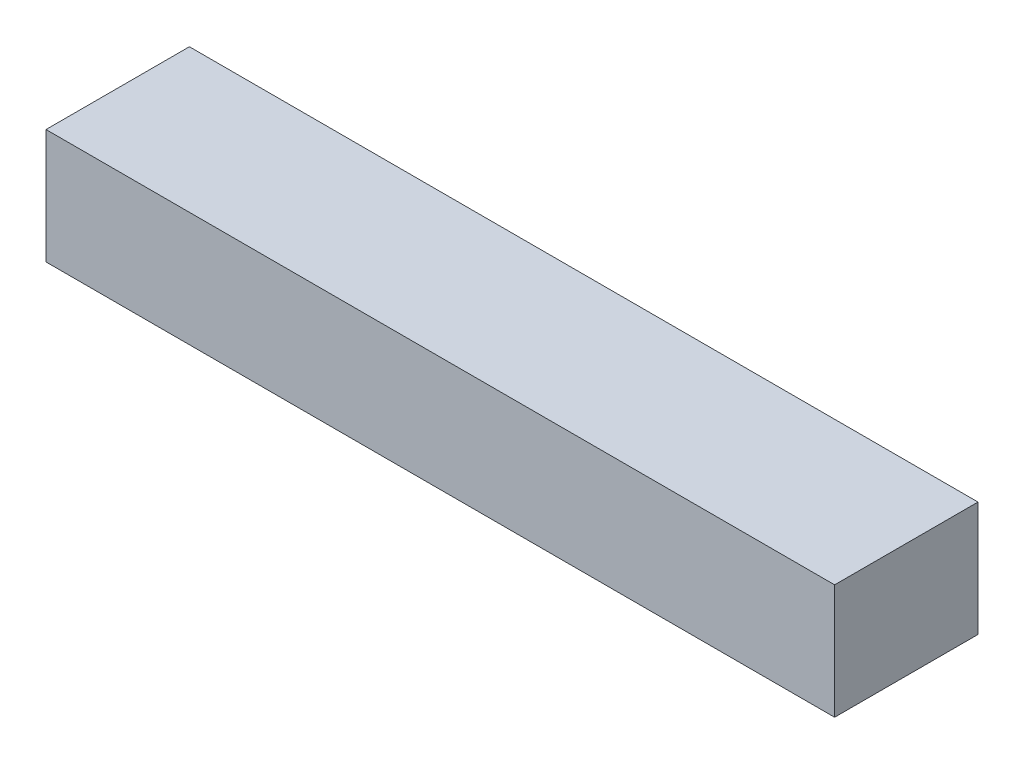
ISO-10303-21;
HEADER;
FILE_DESCRIPTION(('STEP AP214'),'2;1');
FILE_NAME('part.step','',(''),(''),'','','');
FILE_SCHEMA(('AUTOMOTIVE_DESIGN { 1 0 10303 214 1 1 1 1 }'));
ENDSEC;
DATA;
#1=APPLICATION_CONTEXT('core data for automotive mechanical design processes');
#2=APPLICATION_PROTOCOL_DEFINITION('international standard','automotive_design',2000,#1);
#3=PRODUCT_CONTEXT('',#1,'mechanical');
#4=PRODUCT('Part','Part','',(#3));
#5=PRODUCT_RELATED_PRODUCT_CATEGORY('part','',(#4));
#6=PRODUCT_DEFINITION_FORMATION('','',#4);
#7=PRODUCT_DEFINITION_CONTEXT('part definition',#1,'design');
#8=PRODUCT_DEFINITION('design','',#6,#7);
#9=PRODUCT_DEFINITION_SHAPE('','',#8);
#10=(LENGTH_UNIT() NAMED_UNIT(*) SI_UNIT(.MILLI.,.METRE.));
#11=(NAMED_UNIT(*) PLANE_ANGLE_UNIT() SI_UNIT($,.RADIAN.));
#12=(NAMED_UNIT(*) SI_UNIT($,.STERADIAN.) SOLID_ANGLE_UNIT());
#13=UNCERTAINTY_MEASURE_WITH_UNIT(LENGTH_MEASURE(1.E-05),#10,'distance_accuracy_value','');
#14=(GEOMETRIC_REPRESENTATION_CONTEXT(3) GLOBAL_UNCERTAINTY_ASSIGNED_CONTEXT((#13)) GLOBAL_UNIT_ASSIGNED_CONTEXT((#10,
#11,#12)) REPRESENTATION_CONTEXT('',''));
#15=CARTESIAN_POINT('',(0.,0.,0.));
#16=DIRECTION('',(0.,0.,1.));
#17=DIRECTION('',(1.,0.,0.));
#18=AXIS2_PLACEMENT_3D('',#15,#16,#17);
#19=CARTESIAN_POINT('',(27.5,4.,10.));
#20=DIRECTION('',(-1.,0.,0.));
#21=DIRECTION('',(0.,0.,1.));
#22=AXIS2_PLACEMENT_3D('',#19,#20,#21);
#23=PLANE('',#22);
#24=DIRECTION('',(0.,1.,0.));
#25=VECTOR('',#24,1.);
#26=CARTESIAN_POINT('',(27.5,4.,0.));
#27=LINE('',#26,#25);
#28=CARTESIAN_POINT('',(27.5,-4.,0.));
#29=VERTEX_POINT('',#28);
#30=CARTESIAN_POINT('',(27.5,4.,0.));
#31=VERTEX_POINT('',#30);
#32=EDGE_CURVE('E111',#29,#31,#27,.T.);
#33=ORIENTED_EDGE('',*,*,#32,.T.);
#34=DIRECTION('',(0.,0.,-1.));
#35=VECTOR('',#34,1.);
#36=CARTESIAN_POINT('',(27.5,4.,10.));
#37=LINE('',#36,#35);
#38=CARTESIAN_POINT('',(27.5,4.,10.));
#39=VERTEX_POINT('',#38);
#40=EDGE_CURVE('E11',#39,#31,#37,.T.);
#41=ORIENTED_EDGE('',*,*,#40,.F.);
#42=DIRECTION('',(0.,1.,0.));
#43=VECTOR('',#42,1.);
#44=CARTESIAN_POINT('',(27.5,4.,10.));
#45=LINE('',#44,#43);
#46=CARTESIAN_POINT('',(27.5,-4.,10.));
#47=VERTEX_POINT('',#46);
#48=EDGE_CURVE('E95',#47,#39,#45,.T.);
#49=ORIENTED_EDGE('',*,*,#48,.F.);
#50=DIRECTION('',(0.,0.,-1.));
#51=VECTOR('',#50,1.);
#52=CARTESIAN_POINT('',(27.5,-4.,10.));
#53=LINE('',#52,#51);
#54=EDGE_CURVE('E107',#47,#29,#53,.T.);
#55=ORIENTED_EDGE('',*,*,#54,.T.);
#56=EDGE_LOOP('',(#33,#41,#49,#55));
#57=FACE_BOUND('',#56,.T.);
#58=ADVANCED_FACE('F43',(#57),#23,.F.);
#59=CARTESIAN_POINT('',(-27.5,4.,10.));
#60=DIRECTION('',(0.,-1.,0.));
#61=DIRECTION('',(0.,0.,-1.));
#62=AXIS2_PLACEMENT_3D('',#59,#60,#61);
#63=PLANE('',#62);
#64=DIRECTION('',(-1.,0.,0.));
#65=VECTOR('',#64,1.);
#66=CARTESIAN_POINT('',(-27.5,4.,0.));
#67=LINE('',#66,#65);
#68=CARTESIAN_POINT('',(-27.5,4.,0.));
#69=VERTEX_POINT('',#68);
#70=EDGE_CURVE('E100',#31,#69,#67,.T.);
#71=ORIENTED_EDGE('',*,*,#70,.T.);
#72=DIRECTION('',(0.,0.,-1.));
#73=VECTOR('',#72,1.);
#74=CARTESIAN_POINT('',(-27.5,4.,10.));
#75=LINE('',#74,#73);
#76=CARTESIAN_POINT('',(-27.5,4.,10.));
#77=VERTEX_POINT('',#76);
#78=EDGE_CURVE('E52',#77,#69,#75,.T.);
#79=ORIENTED_EDGE('',*,*,#78,.F.);
#80=DIRECTION('',(-1.,0.,0.));
#81=VECTOR('',#80,1.);
#82=CARTESIAN_POINT('',(-27.5,4.,10.));
#83=LINE('',#82,#81);
#84=EDGE_CURVE('E90',#39,#77,#83,.T.);
#85=ORIENTED_EDGE('',*,*,#84,.F.);
#86=ORIENTED_EDGE('',*,*,#40,.T.);
#87=EDGE_LOOP('',(#71,#79,#85,#86));
#88=FACE_BOUND('',#87,.T.);
#89=ADVANCED_FACE('F99',(#88),#63,.F.);
#90=CARTESIAN_POINT('',(-27.5,4.,10.));
#91=DIRECTION('',(1.,0.,0.));
#92=DIRECTION('',(0.,0.,-1.));
#93=AXIS2_PLACEMENT_3D('',#90,#91,#92);
#94=PLANE('',#93);
#95=DIRECTION('',(0.,-1.,0.));
#96=VECTOR('',#95,1.);
#97=CARTESIAN_POINT('',(-27.5,4.,0.));
#98=LINE('',#97,#96);
#99=CARTESIAN_POINT('',(-27.5,-4.,0.));
#100=VERTEX_POINT('',#99);
#101=EDGE_CURVE('E77',#69,#100,#98,.T.);
#102=ORIENTED_EDGE('',*,*,#101,.T.);
#103=DIRECTION('',(0.,0.,-1.));
#104=VECTOR('',#103,1.);
#105=CARTESIAN_POINT('',(-27.5,-4.,10.));
#106=LINE('',#105,#104);
#107=CARTESIAN_POINT('',(-27.5,-4.,10.));
#108=VERTEX_POINT('',#107);
#109=EDGE_CURVE('E102',#108,#100,#106,.T.);
#110=ORIENTED_EDGE('',*,*,#109,.F.);
#111=DIRECTION('',(0.,-1.,0.));
#112=VECTOR('',#111,1.);
#113=CARTESIAN_POINT('',(-27.5,4.,10.));
#114=LINE('',#113,#112);
#115=EDGE_CURVE('E93',#77,#108,#114,.T.);
#116=ORIENTED_EDGE('',*,*,#115,.F.);
#117=ORIENTED_EDGE('',*,*,#78,.T.);
#118=EDGE_LOOP('',(#102,#110,#116,#117));
#119=FACE_BOUND('',#118,.T.);
#120=ADVANCED_FACE('F103',(#119),#94,.F.);
#121=CARTESIAN_POINT('',(-27.5,-4.,10.));
#122=DIRECTION('',(0.,1.,0.));
#123=DIRECTION('',(0.,0.,1.));
#124=AXIS2_PLACEMENT_3D('',#121,#122,#123);
#125=PLANE('',#124);
#126=DIRECTION('',(1.,0.,0.));
#127=VECTOR('',#126,1.);
#128=CARTESIAN_POINT('',(-27.5,-4.,0.));
#129=LINE('',#128,#127);
#130=EDGE_CURVE('E83',#100,#29,#129,.T.);
#131=ORIENTED_EDGE('',*,*,#130,.T.);
#132=ORIENTED_EDGE('',*,*,#54,.F.);
#133=DIRECTION('',(1.,0.,0.));
#134=VECTOR('',#133,1.);
#135=CARTESIAN_POINT('',(-27.5,-4.,10.));
#136=LINE('',#135,#134);
#137=EDGE_CURVE('E60',#108,#47,#136,.T.);
#138=ORIENTED_EDGE('',*,*,#137,.F.);
#139=ORIENTED_EDGE('',*,*,#109,.T.);
#140=EDGE_LOOP('',(#131,#132,#138,#139));
#141=FACE_BOUND('',#140,.T.);
#142=ADVANCED_FACE('F124',(#141),#125,.F.);
#143=CARTESIAN_POINT('',(0.,0.,10.));
#144=DIRECTION('',(0.,0.,1.));
#145=DIRECTION('',(1.,0.,0.));
#146=AXIS2_PLACEMENT_3D('',#143,#144,#145);
#147=PLANE('',#146);
#148=ORIENTED_EDGE('',*,*,#48,.T.);
#149=ORIENTED_EDGE('',*,*,#84,.T.);
#150=ORIENTED_EDGE('',*,*,#115,.T.);
#151=ORIENTED_EDGE('',*,*,#137,.T.);
#152=EDGE_LOOP('',(#148,#149,#150,#151));
#153=FACE_BOUND('',#152,.T.);
#154=ADVANCED_FACE('F91',(#153),#147,.T.);
#155=CARTESIAN_POINT('',(0.,0.,0.));
#156=DIRECTION('',(0.,0.,1.));
#157=DIRECTION('',(1.,0.,0.));
#158=AXIS2_PLACEMENT_3D('',#155,#156,#157);
#159=PLANE('',#158);
#160=ORIENTED_EDGE('',*,*,#32,.F.);
#161=ORIENTED_EDGE('',*,*,#130,.F.);
#162=ORIENTED_EDGE('',*,*,#101,.F.);
#163=ORIENTED_EDGE('',*,*,#70,.F.);
#164=EDGE_LOOP('',(#160,#161,#162,#163));
#165=FACE_BOUND('',#164,.T.);
#166=ADVANCED_FACE('F127',(#165),#159,.F.);
#167=CLOSED_SHELL('',(#58,#89,#120,#142,#154,#166));
#168=MANIFOLD_SOLID_BREP('B2',#167);
#169=ADVANCED_BREP_SHAPE_REPRESENTATION('',(#18,#168),#14);
#170=SHAPE_DEFINITION_REPRESENTATION(#9,#169);
ENDSEC;
END-ISO-10303-21;
